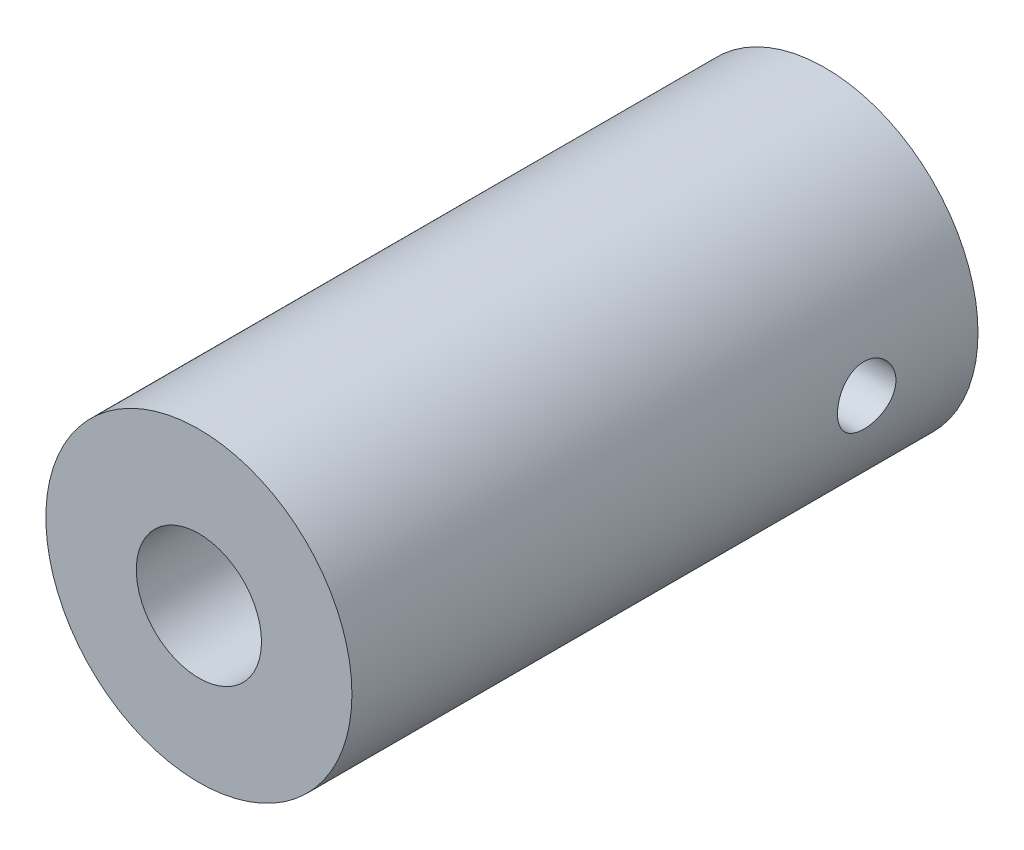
from build123d import *

# Parameters (mm, degrees)
SKETCH1_R              = 11
SKETCH1_R_2            = 4.5
BOSS_EXTRUDE1_DEPTH    = 45
M5_TAPPED_HOLE1_REACH  = 53.284
M5_TAPPED_HOLE1_BORE_R = 2.1


with BuildPart() as part:
    # Sketch1 → Boss-Extrude1 (new body)
    with BuildSketch(Plane.XY):
        with Locations(Location((0, 0, 0), (0, 0, 180))):
            Circle(SKETCH1_R)
        with Locations(Location((0, 0, 0), (0, 0, 180))):
            Circle(SKETCH1_R_2, mode=Mode.SUBTRACT)
    extrude(amount=BOSS_EXTRUDE1_DEPTH)

    # M5 Tapped Hole1 bore → M5 Tapped Hole1 (cut, up to next)
    with BuildSketch(Plane(origin=(11, 0, 0), x_dir=(0, 0, -1), z_dir=(1, 0, 0)), mode=Mode.PRIVATE) as m5_tapped_hole1_sk1:
        with Locations((-8, 0)):
            Circle(M5_TAPPED_HOLE1_BORE_R)
    m5_tapped_hole1_tool1 = extrude(m5_tapped_hole1_sk1.sketch, amount=-M5_TAPPED_HOLE1_REACH, mode=Mode.PRIVATE) & part.part
    add(m5_tapped_hole1_tool1.solids().sort_by_distance((11, 0, 8))[0], mode=Mode.SUBTRACT)


solid = part.part
